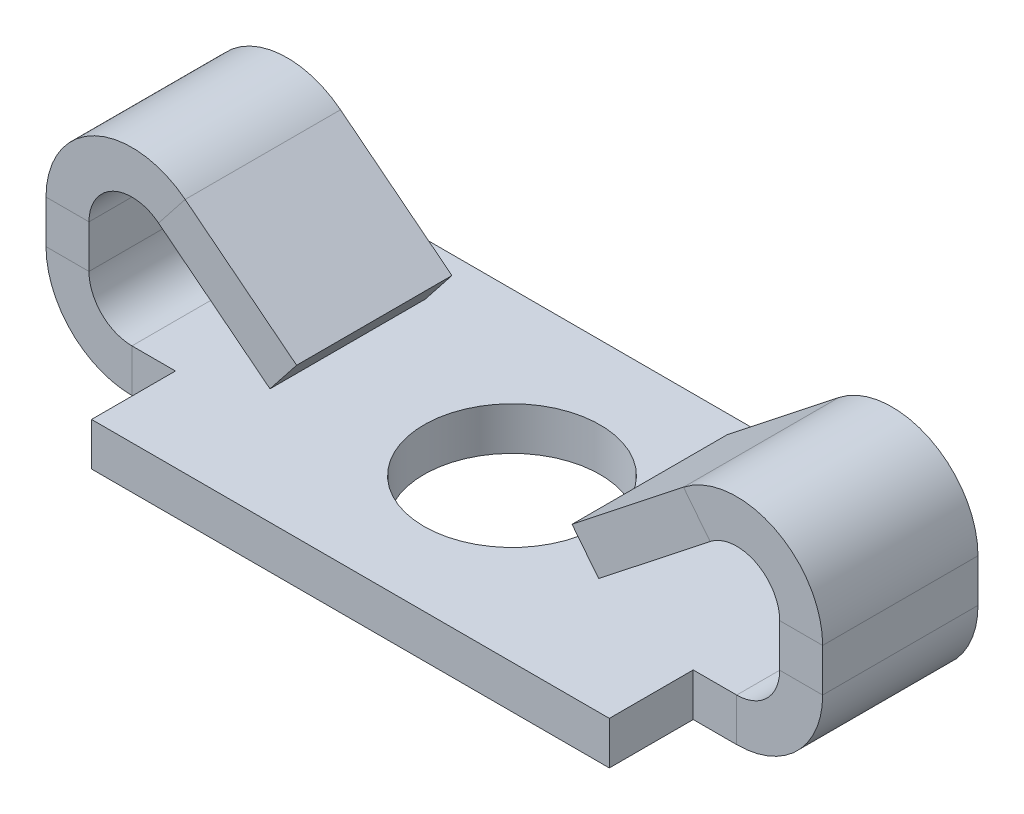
ISO-10303-21;
HEADER;
FILE_DESCRIPTION(('STEP AP214'),'2;1');
FILE_NAME('part.step','',(''),(''),'','','');
FILE_SCHEMA(('AUTOMOTIVE_DESIGN { 1 0 10303 214 1 1 1 1 }'));
ENDSEC;
DATA;
#1=APPLICATION_CONTEXT('core data for automotive mechanical design processes');
#2=APPLICATION_PROTOCOL_DEFINITION('international standard','automotive_design',2000,#1);
#3=PRODUCT_CONTEXT('',#1,'mechanical');
#4=PRODUCT('Part','Part','',(#3));
#5=PRODUCT_RELATED_PRODUCT_CATEGORY('part','',(#4));
#6=PRODUCT_DEFINITION_FORMATION('','',#4);
#7=PRODUCT_DEFINITION_CONTEXT('part definition',#1,'design');
#8=PRODUCT_DEFINITION('design','',#6,#7);
#9=PRODUCT_DEFINITION_SHAPE('','',#8);
#10=(LENGTH_UNIT() NAMED_UNIT(*) SI_UNIT(.MILLI.,.METRE.));
#11=(NAMED_UNIT(*) PLANE_ANGLE_UNIT() SI_UNIT($,.RADIAN.));
#12=(NAMED_UNIT(*) SI_UNIT($,.STERADIAN.) SOLID_ANGLE_UNIT());
#13=UNCERTAINTY_MEASURE_WITH_UNIT(LENGTH_MEASURE(1.E-05),#10,'distance_accuracy_value','');
#14=(GEOMETRIC_REPRESENTATION_CONTEXT(3) GLOBAL_UNCERTAINTY_ASSIGNED_CONTEXT((#13)) GLOBAL_UNIT_ASSIGNED_CONTEXT((#10,
#11,#12)) REPRESENTATION_CONTEXT('',''));
#15=CARTESIAN_POINT('',(0.,0.,0.));
#16=DIRECTION('',(0.,0.,1.));
#17=DIRECTION('',(1.,0.,0.));
#18=AXIS2_PLACEMENT_3D('',#15,#16,#17);
#19=CARTESIAN_POINT('',(19.05,0.,7.9248));
#20=DIRECTION('',(0.,-1.,0.));
#21=DIRECTION('',(0.,0.,-1.));
#22=AXIS2_PLACEMENT_3D('',#19,#20,#21);
#23=PLANE('',#22);
#24=CARTESIAN_POINT('',(0.,0.,0.));
#25=DIRECTION('',(0.,1.,0.));
#26=DIRECTION('',(0.,0.,1.));
#27=AXIS2_PLACEMENT_3D('',#24,#25,#26);
#28=CIRCLE('',#27,4.318);
#29=CARTESIAN_POINT('',(0.,0.,4.318));
#30=VERTEX_POINT('',#29);
#31=EDGE_CURVE('E624',#30,#30,#28,.T.);
#32=ORIENTED_EDGE('',*,*,#31,.T.);
#33=EDGE_LOOP('',(#32));
#34=FACE_BOUND('',#33,.T.);
#35=DIRECTION('',(-1.,0.,0.));
#36=VECTOR('',#35,1.);
#37=CARTESIAN_POINT('',(19.05,0.,7.9248));
#38=LINE('',#37,#36);
#39=CARTESIAN_POINT('',(12.7,0.,7.9248));
#40=VERTEX_POINT('',#39);
#41=CARTESIAN_POINT('',(-12.7,0.,7.9248));
#42=VERTEX_POINT('',#41);
#43=EDGE_CURVE('E778',#40,#42,#38,.T.);
#44=ORIENTED_EDGE('',*,*,#43,.T.);
#45=DIRECTION('',(0.,0.,-1.));
#46=VECTOR('',#45,1.);
#47=CARTESIAN_POINT('',(-12.7,0.,7.9248));
#48=LINE('',#47,#46);
#49=CARTESIAN_POINT('',(-12.7,0.,3.81));
#50=VERTEX_POINT('',#49);
#51=EDGE_CURVE('E570',#42,#50,#48,.T.);
#52=ORIENTED_EDGE('',*,*,#51,.T.);
#53=DIRECTION('',(1.,0.,0.));
#54=VECTOR('',#53,1.);
#55=CARTESIAN_POINT('',(19.05,0.,3.81));
#56=LINE('',#55,#54);
#57=CARTESIAN_POINT('',(-14.8336,0.,3.81));
#58=VERTEX_POINT('',#57);
#59=EDGE_CURVE('E563',#50,#58,#56,.F.);
#60=ORIENTED_EDGE('',*,*,#59,.T.);
#61=DIRECTION('',(0.,0.,-1.));
#62=VECTOR('',#61,1.);
#63=CARTESIAN_POINT('',(-14.8336,0.,7.9248));
#64=LINE('',#63,#62);
#65=CARTESIAN_POINT('',(-14.8335999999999,0.,-3.81));
#66=VERTEX_POINT('',#65);
#67=EDGE_CURVE('E819',#58,#66,#64,.T.);
#68=ORIENTED_EDGE('',*,*,#67,.T.);
#69=DIRECTION('',(1.,0.,0.));
#70=VECTOR('',#69,1.);
#71=CARTESIAN_POINT('',(-14.8336,0.,-3.81));
#72=LINE('',#71,#70);
#73=CARTESIAN_POINT('',(-12.7,0.,-3.81000000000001));
#74=VERTEX_POINT('',#73);
#75=EDGE_CURVE('E575',#66,#74,#72,.T.);
#76=ORIENTED_EDGE('',*,*,#75,.T.);
#77=DIRECTION('',(0.,0.,-1.));
#78=VECTOR('',#77,1.);
#79=CARTESIAN_POINT('',(-12.7,0.,-7.9248));
#80=LINE('',#79,#78);
#81=CARTESIAN_POINT('',(-12.7,0.,-7.9248));
#82=VERTEX_POINT('',#81);
#83=EDGE_CURVE('E579',#74,#82,#80,.T.);
#84=ORIENTED_EDGE('',*,*,#83,.T.);
#85=DIRECTION('',(-1.,0.,0.));
#86=VECTOR('',#85,1.);
#87=CARTESIAN_POINT('',(19.05,0.,-7.9248));
#88=LINE('',#87,#86);
#89=CARTESIAN_POINT('',(12.7,0.,-7.9248));
#90=VERTEX_POINT('',#89);
#91=EDGE_CURVE('E771',#90,#82,#88,.T.);
#92=ORIENTED_EDGE('',*,*,#91,.F.);
#93=DIRECTION('',(0.,0.,-1.));
#94=VECTOR('',#93,1.);
#95=CARTESIAN_POINT('',(12.7,0.,7.9248));
#96=LINE('',#95,#94);
#97=CARTESIAN_POINT('',(12.7,0.,-3.81));
#98=VERTEX_POINT('',#97);
#99=EDGE_CURVE('E596',#90,#98,#96,.F.);
#100=ORIENTED_EDGE('',*,*,#99,.T.);
#101=DIRECTION('',(1.,0.,0.));
#102=VECTOR('',#101,1.);
#103=CARTESIAN_POINT('',(19.05,0.,-3.81));
#104=LINE('',#103,#102);
#105=CARTESIAN_POINT('',(14.8336,0.,-3.81));
#106=VERTEX_POINT('',#105);
#107=EDGE_CURVE('E599',#98,#106,#104,.T.);
#108=ORIENTED_EDGE('',*,*,#107,.T.);
#109=DIRECTION('',(0.,0.,-1.));
#110=VECTOR('',#109,1.);
#111=CARTESIAN_POINT('',(14.8336,0.,7.9248));
#112=LINE('',#111,#110);
#113=CARTESIAN_POINT('',(14.8336,0.,3.81));
#114=VERTEX_POINT('',#113);
#115=EDGE_CURVE('E816',#114,#106,#112,.T.);
#116=ORIENTED_EDGE('',*,*,#115,.F.);
#117=DIRECTION('',(-1.,0.,0.));
#118=VECTOR('',#117,1.);
#119=CARTESIAN_POINT('',(14.8336,0.,3.81));
#120=LINE('',#119,#118);
#121=CARTESIAN_POINT('',(12.7,0.,3.81));
#122=VERTEX_POINT('',#121);
#123=EDGE_CURVE('E606',#114,#122,#120,.T.);
#124=ORIENTED_EDGE('',*,*,#123,.T.);
#125=DIRECTION('',(0.,0.,1.));
#126=VECTOR('',#125,1.);
#127=CARTESIAN_POINT('',(12.7,0.,7.9248));
#128=LINE('',#127,#126);
#129=EDGE_CURVE('E611',#122,#40,#128,.T.);
#130=ORIENTED_EDGE('',*,*,#129,.T.);
#131=EDGE_LOOP('',(#44,#52,#60,#68,#76,#84,#92,#100,#108,#116,#124,#130));
#132=FACE_BOUND('',#131,.T.);
#133=ADVANCED_FACE('F360',(#34,#132),#23,.T.);
#134=CARTESIAN_POINT('',(19.05,2.10819999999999,7.9248));
#135=DIRECTION('',(0.,-1.,0.));
#136=DIRECTION('',(0.,0.,-1.));
#137=AXIS2_PLACEMENT_3D('',#134,#135,#136);
#138=PLANE('',#137);
#139=CARTESIAN_POINT('',(0.,2.10819999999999,0.));
#140=DIRECTION('',(0.,1.,0.));
#141=DIRECTION('',(0.,0.,1.));
#142=AXIS2_PLACEMENT_3D('',#139,#140,#141);
#143=CIRCLE('',#142,4.318);
#144=CARTESIAN_POINT('',(0.,2.10819999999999,4.318));
#145=VERTEX_POINT('',#144);
#146=EDGE_CURVE('E627',#145,#145,#143,.T.);
#147=ORIENTED_EDGE('',*,*,#146,.F.);
#148=EDGE_LOOP('',(#147));
#149=FACE_BOUND('',#148,.T.);
#150=DIRECTION('',(0.,0.,-1.));
#151=VECTOR('',#150,1.);
#152=CARTESIAN_POINT('',(-12.7,2.10819999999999,7.9248));
#153=LINE('',#152,#151);
#154=CARTESIAN_POINT('',(-12.7,2.10819999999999,7.9248));
#155=VERTEX_POINT('',#154);
#156=CARTESIAN_POINT('',(-12.7,2.10819999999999,3.81));
#157=VERTEX_POINT('',#156);
#158=EDGE_CURVE('E546',#155,#157,#153,.T.);
#159=ORIENTED_EDGE('',*,*,#158,.F.);
#160=DIRECTION('',(1.,0.,0.));
#161=VECTOR('',#160,1.);
#162=CARTESIAN_POINT('',(19.05,2.10819999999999,7.9248));
#163=LINE('',#162,#161);
#164=CARTESIAN_POINT('',(12.7,2.10819999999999,7.9248));
#165=VERTEX_POINT('',#164);
#166=EDGE_CURVE('E781',#165,#155,#163,.F.);
#167=ORIENTED_EDGE('',*,*,#166,.F.);
#168=DIRECTION('',(0.,0.,-1.));
#169=VECTOR('',#168,1.);
#170=CARTESIAN_POINT('',(12.7,2.10819999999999,7.9248));
#171=LINE('',#170,#169);
#172=CARTESIAN_POINT('',(12.7,2.10819999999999,3.81));
#173=VERTEX_POINT('',#172);
#174=EDGE_CURVE('E616',#173,#165,#171,.F.);
#175=ORIENTED_EDGE('',*,*,#174,.F.);
#176=DIRECTION('',(1.,0.,0.));
#177=VECTOR('',#176,1.);
#178=CARTESIAN_POINT('',(19.05,2.10819999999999,3.81));
#179=LINE('',#178,#177);
#180=CARTESIAN_POINT('',(14.8336,2.10819999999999,3.81));
#181=VERTEX_POINT('',#180);
#182=EDGE_CURVE('E614',#181,#173,#179,.F.);
#183=ORIENTED_EDGE('',*,*,#182,.F.);
#184=DIRECTION('',(0.,0.,-1.));
#185=VECTOR('',#184,1.);
#186=CARTESIAN_POINT('',(14.8336,2.10819999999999,7.9248));
#187=LINE('',#186,#185);
#188=CARTESIAN_POINT('',(14.8336,2.10819999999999,-3.81));
#189=VERTEX_POINT('',#188);
#190=EDGE_CURVE('E789',#181,#189,#187,.T.);
#191=ORIENTED_EDGE('',*,*,#190,.T.);
#192=DIRECTION('',(1.,0.,0.));
#193=VECTOR('',#192,1.);
#194=CARTESIAN_POINT('',(14.8336,2.10819999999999,-3.81000000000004));
#195=LINE('',#194,#193);
#196=CARTESIAN_POINT('',(12.7,2.10819999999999,-3.81));
#197=VERTEX_POINT('',#196);
#198=EDGE_CURVE('E594',#197,#189,#195,.T.);
#199=ORIENTED_EDGE('',*,*,#198,.F.);
#200=DIRECTION('',(0.,0.,1.));
#201=VECTOR('',#200,1.);
#202=CARTESIAN_POINT('',(12.7,2.10819999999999,-7.9248));
#203=LINE('',#202,#201);
#204=CARTESIAN_POINT('',(12.7,2.10819999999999,-7.9248));
#205=VERTEX_POINT('',#204);
#206=EDGE_CURVE('E592',#205,#197,#203,.T.);
#207=ORIENTED_EDGE('',*,*,#206,.F.);
#208=DIRECTION('',(1.,0.,0.));
#209=VECTOR('',#208,1.);
#210=CARTESIAN_POINT('',(19.05,2.10819999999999,-7.9248));
#211=LINE('',#210,#209);
#212=CARTESIAN_POINT('',(-12.7,2.10819999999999,-7.9248));
#213=VERTEX_POINT('',#212);
#214=EDGE_CURVE('E775',#205,#213,#211,.F.);
#215=ORIENTED_EDGE('',*,*,#214,.T.);
#216=DIRECTION('',(0.,0.,-1.));
#217=VECTOR('',#216,1.);
#218=CARTESIAN_POINT('',(-12.7,2.10819999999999,7.9248));
#219=LINE('',#218,#217);
#220=CARTESIAN_POINT('',(-12.7,2.10819999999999,-3.81000000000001));
#221=VERTEX_POINT('',#220);
#222=EDGE_CURVE('E584',#221,#213,#219,.T.);
#223=ORIENTED_EDGE('',*,*,#222,.F.);
#224=DIRECTION('',(1.,0.,0.));
#225=VECTOR('',#224,1.);
#226=CARTESIAN_POINT('',(19.05,2.10819999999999,-3.81));
#227=LINE('',#226,#225);
#228=CARTESIAN_POINT('',(-14.8335999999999,2.10819999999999,-3.81));
#229=VERTEX_POINT('',#228);
#230=EDGE_CURVE('E582',#229,#221,#227,.T.);
#231=ORIENTED_EDGE('',*,*,#230,.F.);
#232=DIRECTION('',(0.,0.,-1.));
#233=VECTOR('',#232,1.);
#234=CARTESIAN_POINT('',(-14.8336,2.10819999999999,7.9248));
#235=LINE('',#234,#233);
#236=CARTESIAN_POINT('',(-14.8336,2.10819999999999,3.81));
#237=VERTEX_POINT('',#236);
#238=EDGE_CURVE('E569',#237,#229,#235,.T.);
#239=ORIENTED_EDGE('',*,*,#238,.F.);
#240=DIRECTION('',(-1.,0.,0.));
#241=VECTOR('',#240,1.);
#242=CARTESIAN_POINT('',(-14.8336,2.10819999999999,3.81000000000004));
#243=LINE('',#242,#241);
#244=EDGE_CURVE('E557',#157,#237,#243,.T.);
#245=ORIENTED_EDGE('',*,*,#244,.F.);
#246=EDGE_LOOP('',(#159,#167,#175,#183,#191,#199,#207,#215,#223,#231,#239,#245));
#247=FACE_BOUND('',#246,.T.);
#248=ADVANCED_FACE('F566',(#149,#247),#138,.F.);
#249=CARTESIAN_POINT('',(16.9418,4.21639999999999,7.9248));
#250=DIRECTION('',(0.,0.,1.));
#251=DIRECTION('',(1.,0.,0.));
#252=AXIS2_PLACEMENT_3D('',#249,#250,#251);
#253=PLANE('',#252);
#254=ORIENTED_EDGE('',*,*,#166,.T.);
#255=DIRECTION('',(0.,1.,0.));
#256=VECTOR('',#255,1.);
#257=CARTESIAN_POINT('',(-12.7,2.10819999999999,7.9248));
#258=LINE('',#257,#256);
#259=EDGE_CURVE('E552',#155,#42,#258,.F.);
#260=ORIENTED_EDGE('',*,*,#259,.T.);
#261=ORIENTED_EDGE('',*,*,#43,.F.);
#262=DIRECTION('',(0.,-1.,0.));
#263=VECTOR('',#262,1.);
#264=CARTESIAN_POINT('',(12.7,0.,7.9248));
#265=LINE('',#264,#263);
#266=EDGE_CURVE('E621',#40,#165,#265,.F.);
#267=ORIENTED_EDGE('',*,*,#266,.T.);
#268=EDGE_LOOP('',(#254,#260,#261,#267));
#269=FACE_BOUND('',#268,.T.);
#270=ADVANCED_FACE('F896',(#269),#253,.T.);
#271=CARTESIAN_POINT('',(-16.9418,4.21639999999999,-7.9248));
#272=DIRECTION('',(0.,0.,-1.));
#273=DIRECTION('',(-1.,0.,0.));
#274=AXIS2_PLACEMENT_3D('',#271,#272,#273);
#275=PLANE('',#274);
#276=ORIENTED_EDGE('',*,*,#91,.T.);
#277=DIRECTION('',(0.,-1.,0.));
#278=VECTOR('',#277,1.);
#279=CARTESIAN_POINT('',(-12.7,0.,-7.9248));
#280=LINE('',#279,#278);
#281=EDGE_CURVE('E589',#82,#213,#280,.F.);
#282=ORIENTED_EDGE('',*,*,#281,.T.);
#283=ORIENTED_EDGE('',*,*,#214,.F.);
#284=DIRECTION('',(0.,1.,0.));
#285=VECTOR('',#284,1.);
#286=CARTESIAN_POINT('',(12.7,2.10819999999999,-7.9248));
#287=LINE('',#286,#285);
#288=EDGE_CURVE('E603',#205,#90,#287,.F.);
#289=ORIENTED_EDGE('',*,*,#288,.T.);
#290=EDGE_LOOP('',(#276,#282,#283,#289));
#291=FACE_BOUND('',#290,.T.);
#292=ADVANCED_FACE('F362',(#291),#275,.T.);
#293=CARTESIAN_POINT('',(-20.355268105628,13.3616349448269,7.9248));
#294=DIRECTION('',(0.619138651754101,0.785281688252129,0.));
#295=DIRECTION('',(-0.785281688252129,0.619138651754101,0.));
#296=AXIS2_PLACEMENT_3D('',#293,#294,#295);
#297=PLANE('',#296);
#298=DIRECTION('',(-0.785281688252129,0.619138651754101,0.));
#299=VECTOR('',#298,1.);
#300=CARTESIAN_POINT('',(-20.355268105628,13.3616349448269,3.81));
#301=LINE('',#300,#299);
#302=CARTESIAN_POINT('',(-13.528331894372,7.97908223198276,3.81));
#303=VERTEX_POINT('',#302);
#304=CARTESIAN_POINT('',(-8.06166810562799,3.66900739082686,3.81));
#305=VERTEX_POINT('',#304);
#306=EDGE_CURVE('E645',#303,#305,#301,.F.);
#307=ORIENTED_EDGE('',*,*,#306,.F.);
#308=DIRECTION('',(0.,0.,-1.));
#309=VECTOR('',#308,1.);
#310=CARTESIAN_POINT('',(-13.528331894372,7.97908223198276,7.9248));
#311=LINE('',#310,#309);
#312=CARTESIAN_POINT('',(-13.528331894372,7.97908223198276,-3.81));
#313=VERTEX_POINT('',#312);
#314=EDGE_CURVE('E375',#303,#313,#311,.T.);
#315=ORIENTED_EDGE('',*,*,#314,.T.);
#316=DIRECTION('',(-0.785281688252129,0.619138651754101,0.));
#317=VECTOR('',#316,1.);
#318=CARTESIAN_POINT('',(-20.355268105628,13.3616349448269,-3.81));
#319=LINE('',#318,#317);
#320=CARTESIAN_POINT('',(-8.06166810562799,3.66900739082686,-3.81));
#321=VERTEX_POINT('',#320);
#322=EDGE_CURVE('E679',#321,#313,#319,.T.);
#323=ORIENTED_EDGE('',*,*,#322,.F.);
#324=DIRECTION('',(0.,0.,-1.));
#325=VECTOR('',#324,1.);
#326=CARTESIAN_POINT('',(-8.06166810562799,3.66900739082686,7.9248));
#327=LINE('',#326,#325);
#328=EDGE_CURVE('E11',#305,#321,#327,.T.);
#329=ORIENTED_EDGE('',*,*,#328,.F.);
#330=EDGE_LOOP('',(#307,#315,#323,#329));
#331=FACE_BOUND('',#330,.T.);
#332=ADVANCED_FACE('F839',(#331),#297,.F.);
#333=CARTESIAN_POINT('',(-6.7564,5.324538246,7.9248));
#334=DIRECTION('',(0.78528168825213,-0.6191386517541,0.));
#335=DIRECTION('',(0.6191386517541,0.78528168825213,0.));
#336=AXIS2_PLACEMENT_3D('',#333,#334,#335);
#337=PLANE('',#336);
#338=DIRECTION('',(0.,0.,-1.));
#339=VECTOR('',#338,1.);
#340=CARTESIAN_POINT('',(-6.7564,5.324538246,7.9248));
#341=LINE('',#340,#339);
#342=CARTESIAN_POINT('',(-6.7564,5.324538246,3.81));
#343=VERTEX_POINT('',#342);
#344=CARTESIAN_POINT('',(-6.75639999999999,5.32453824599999,-3.81000000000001));
#345=VERTEX_POINT('',#344);
#346=EDGE_CURVE('E368',#343,#345,#341,.T.);
#347=ORIENTED_EDGE('',*,*,#346,.F.);
#348=DIRECTION('',(0.619138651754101,0.785281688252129,0.));
#349=VECTOR('',#348,1.);
#350=CARTESIAN_POINT('',(-6.7564,5.324538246,3.81));
#351=LINE('',#350,#349);
#352=EDGE_CURVE('E648',#343,#305,#351,.F.);
#353=ORIENTED_EDGE('',*,*,#352,.T.);
#354=ORIENTED_EDGE('',*,*,#328,.T.);
#355=DIRECTION('',(-0.619138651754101,-0.785281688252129,0.));
#356=VECTOR('',#355,1.);
#357=CARTESIAN_POINT('',(-8.06166810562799,3.66900739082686,-3.81));
#358=LINE('',#357,#356);
#359=EDGE_CURVE('E685',#321,#345,#358,.F.);
#360=ORIENTED_EDGE('',*,*,#359,.T.);
#361=EDGE_LOOP('',(#347,#353,#354,#360));
#362=FACE_BOUND('',#361,.T.);
#363=ADVANCED_FACE('F837',(#362),#337,.T.);
#364=CARTESIAN_POINT('',(-19.05,15.0171658,7.9248));
#365=DIRECTION('',(0.619138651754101,0.785281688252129,0.));
#366=DIRECTION('',(-0.785281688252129,0.619138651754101,0.));
#367=AXIS2_PLACEMENT_3D('',#364,#365,#366);
#368=PLANE('',#367);
#369=DIRECTION('',(0.,0.,-1.));
#370=VECTOR('',#369,1.);
#371=CARTESIAN_POINT('',(-12.223063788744,9.6346130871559,7.9248));
#372=LINE('',#371,#370);
#373=CARTESIAN_POINT('',(-12.223063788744,9.6346130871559,3.81));
#374=VERTEX_POINT('',#373);
#375=CARTESIAN_POINT('',(-12.223063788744,9.63461308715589,-3.81));
#376=VERTEX_POINT('',#375);
#377=EDGE_CURVE('E826',#374,#376,#372,.T.);
#378=ORIENTED_EDGE('',*,*,#377,.F.);
#379=DIRECTION('',(0.785281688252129,-0.619138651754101,0.));
#380=VECTOR('',#379,1.);
#381=CARTESIAN_POINT('',(-19.05,15.0171658,3.81));
#382=LINE('',#381,#380);
#383=EDGE_CURVE('E642',#374,#343,#382,.T.);
#384=ORIENTED_EDGE('',*,*,#383,.T.);
#385=ORIENTED_EDGE('',*,*,#346,.T.);
#386=DIRECTION('',(-0.785281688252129,0.619138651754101,0.));
#387=VECTOR('',#386,1.);
#388=CARTESIAN_POINT('',(-19.05,15.0171658,-3.81000000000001));
#389=LINE('',#388,#387);
#390=EDGE_CURVE('E682',#345,#376,#389,.T.);
#391=ORIENTED_EDGE('',*,*,#390,.T.);
#392=EDGE_LOOP('',(#378,#384,#385,#391));
#393=FACE_BOUND('',#392,.T.);
#394=ADVANCED_FACE('F831',(#393),#368,.T.);
#395=CARTESIAN_POINT('',(-14.8336,6.32355137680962,7.9248));
#396=DIRECTION('',(0.,0.,-1.));
#397=DIRECTION('',(-1.,0.,0.));
#398=AXIS2_PLACEMENT_3D('',#395,#396,#397);
#399=CYLINDRICAL_SURFACE('',#398,4.2164);
#400=DIRECTION('',(0.,0.,-1.));
#401=VECTOR('',#400,1.);
#402=CARTESIAN_POINT('',(-19.05,6.32355137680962,7.9248));
#403=LINE('',#402,#401);
#404=CARTESIAN_POINT('',(-19.05,6.32355137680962,3.81));
#405=VERTEX_POINT('',#404);
#406=CARTESIAN_POINT('',(-19.05,6.32355137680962,-3.81));
#407=VERTEX_POINT('',#406);
#408=EDGE_CURVE('E824',#405,#407,#403,.T.);
#409=ORIENTED_EDGE('',*,*,#408,.F.);
#410=CARTESIAN_POINT('',(-14.8336,6.32355137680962,3.81));
#411=DIRECTION('',(0.,0.,1.));
#412=DIRECTION('',(1.,0.,0.));
#413=AXIS2_PLACEMENT_3D('',#410,#411,#412);
#414=CIRCLE('',#413,4.2164);
#415=EDGE_CURVE('E637',#405,#374,#414,.F.);
#416=ORIENTED_EDGE('',*,*,#415,.T.);
#417=ORIENTED_EDGE('',*,*,#377,.T.);
#418=CARTESIAN_POINT('',(-14.8336,6.32355137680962,-3.81));
#419=DIRECTION('',(0.,0.,-1.));
#420=DIRECTION('',(-1.,0.,0.));
#421=AXIS2_PLACEMENT_3D('',#418,#419,#420);
#422=CIRCLE('',#421,4.2164);
#423=EDGE_CURVE('E676',#376,#407,#422,.F.);
#424=ORIENTED_EDGE('',*,*,#423,.T.);
#425=EDGE_LOOP('',(#409,#416,#417,#424));
#426=FACE_BOUND('',#425,.T.);
#427=ADVANCED_FACE('F870',(#426),#399,.T.);
#428=CARTESIAN_POINT('',(-19.05,0.,7.9248));
#429=DIRECTION('',(-1.,0.,0.));
#430=DIRECTION('',(0.,0.,1.));
#431=AXIS2_PLACEMENT_3D('',#428,#429,#430);
#432=PLANE('',#431);
#433=DIRECTION('',(0.,0.,-1.));
#434=VECTOR('',#433,1.);
#435=CARTESIAN_POINT('',(-19.05,4.21639999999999,7.9248));
#436=LINE('',#435,#434);
#437=CARTESIAN_POINT('',(-19.05,4.21639999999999,3.81));
#438=VERTEX_POINT('',#437);
#439=CARTESIAN_POINT('',(-19.05,4.21639999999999,-3.81));
#440=VERTEX_POINT('',#439);
#441=EDGE_CURVE('E822',#438,#440,#436,.T.);
#442=ORIENTED_EDGE('',*,*,#441,.F.);
#443=DIRECTION('',(0.,-1.,0.));
#444=VECTOR('',#443,1.);
#445=CARTESIAN_POINT('',(-19.05,10.5399513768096,3.81));
#446=LINE('',#445,#444);
#447=EDGE_CURVE('E651',#405,#438,#446,.T.);
#448=ORIENTED_EDGE('',*,*,#447,.F.);
#449=ORIENTED_EDGE('',*,*,#408,.T.);
#450=DIRECTION('',(0.,-1.,0.));
#451=VECTOR('',#450,1.);
#452=CARTESIAN_POINT('',(-19.05,10.5399513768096,-3.81));
#453=LINE('',#452,#451);
#454=EDGE_CURVE('E689',#407,#440,#453,.T.);
#455=ORIENTED_EDGE('',*,*,#454,.T.);
#456=EDGE_LOOP('',(#442,#448,#449,#455));
#457=FACE_BOUND('',#456,.T.);
#458=ADVANCED_FACE('F866',(#457),#432,.T.);
#459=CARTESIAN_POINT('',(-14.8336,4.21639999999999,7.9248));
#460=DIRECTION('',(0.,0.,-1.));
#461=DIRECTION('',(-1.,0.,0.));
#462=AXIS2_PLACEMENT_3D('',#459,#460,#461);
#463=CYLINDRICAL_SURFACE('',#462,4.2164);
#464=ORIENTED_EDGE('',*,*,#67,.F.);
#465=CARTESIAN_POINT('',(-14.8336,4.21639999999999,3.81));
#466=DIRECTION('',(0.,0.,1.));
#467=DIRECTION('',(1.,0.,0.));
#468=AXIS2_PLACEMENT_3D('',#465,#466,#467);
#469=CIRCLE('',#468,4.2164);
#470=EDGE_CURVE('E632',#58,#438,#469,.F.);
#471=ORIENTED_EDGE('',*,*,#470,.T.);
#472=ORIENTED_EDGE('',*,*,#441,.T.);
#473=CARTESIAN_POINT('',(-14.8336,4.21639999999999,-3.81));
#474=DIRECTION('',(0.,0.,-1.));
#475=DIRECTION('',(-1.,0.,0.));
#476=AXIS2_PLACEMENT_3D('',#473,#474,#475);
#477=CIRCLE('',#476,4.2164);
#478=EDGE_CURVE('E667',#440,#66,#477,.F.);
#479=ORIENTED_EDGE('',*,*,#478,.T.);
#480=EDGE_LOOP('',(#464,#471,#472,#479));
#481=FACE_BOUND('',#480,.T.);
#482=ADVANCED_FACE('F904',(#481),#463,.T.);
#483=CARTESIAN_POINT('',(-14.8336,4.21639999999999,7.9248));
#484=DIRECTION('',(0.,0.,-1.));
#485=DIRECTION('',(-1.,0.,0.));
#486=AXIS2_PLACEMENT_3D('',#483,#484,#485);
#487=CYLINDRICAL_SURFACE('',#486,2.1082);
#488=CARTESIAN_POINT('',(-14.8336,4.21639999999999,3.81));
#489=DIRECTION('',(0.,0.,-1.));
#490=DIRECTION('',(-1.,0.,0.));
#491=AXIS2_PLACEMENT_3D('',#488,#489,#490);
#492=CIRCLE('',#491,2.1082);
#493=CARTESIAN_POINT('',(-16.9418,4.21639999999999,3.81));
#494=VERTEX_POINT('',#493);
#495=EDGE_CURVE('E635',#237,#494,#492,.T.);
#496=ORIENTED_EDGE('',*,*,#495,.F.);
#497=ORIENTED_EDGE('',*,*,#238,.T.);
#498=CARTESIAN_POINT('',(-14.8336,4.21639999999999,-3.81));
#499=DIRECTION('',(0.,0.,-1.));
#500=DIRECTION('',(-1.,0.,0.));
#501=AXIS2_PLACEMENT_3D('',#498,#499,#500);
#502=CIRCLE('',#501,2.1082);
#503=CARTESIAN_POINT('',(-16.9418,4.21639999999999,-3.81));
#504=VERTEX_POINT('',#503);
#505=EDGE_CURVE('E670',#504,#229,#502,.F.);
#506=ORIENTED_EDGE('',*,*,#505,.F.);
#507=DIRECTION('',(0.,0.,-1.));
#508=VECTOR('',#507,1.);
#509=CARTESIAN_POINT('',(-16.9418,4.21639999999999,7.9248));
#510=LINE('',#509,#508);
#511=EDGE_CURVE('E786',#494,#504,#510,.T.);
#512=ORIENTED_EDGE('',*,*,#511,.F.);
#513=EDGE_LOOP('',(#496,#497,#506,#512));
#514=FACE_BOUND('',#513,.T.);
#515=ADVANCED_FACE('F860',(#514),#487,.F.);
#516=CARTESIAN_POINT('',(-16.9418,0.,7.9248));
#517=DIRECTION('',(-1.,0.,0.));
#518=DIRECTION('',(0.,0.,1.));
#519=AXIS2_PLACEMENT_3D('',#516,#517,#518);
#520=PLANE('',#519);
#521=DIRECTION('',(0.,1.,0.));
#522=VECTOR('',#521,1.);
#523=CARTESIAN_POINT('',(-16.9418,0.,3.81));
#524=LINE('',#523,#522);
#525=CARTESIAN_POINT('',(-16.9418,6.32355137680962,3.81));
#526=VERTEX_POINT('',#525);
#527=EDGE_CURVE('E655',#526,#494,#524,.F.);
#528=ORIENTED_EDGE('',*,*,#527,.T.);
#529=ORIENTED_EDGE('',*,*,#511,.T.);
#530=DIRECTION('',(0.,1.,0.));
#531=VECTOR('',#530,1.);
#532=CARTESIAN_POINT('',(-16.9418,0.,-3.81));
#533=LINE('',#532,#531);
#534=CARTESIAN_POINT('',(-16.9418,6.32355137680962,-3.81));
#535=VERTEX_POINT('',#534);
#536=EDGE_CURVE('E694',#535,#504,#533,.F.);
#537=ORIENTED_EDGE('',*,*,#536,.F.);
#538=DIRECTION('',(0.,0.,-1.));
#539=VECTOR('',#538,1.);
#540=CARTESIAN_POINT('',(-16.9418,6.32355137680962,7.9248));
#541=LINE('',#540,#539);
#542=EDGE_CURVE('E784',#526,#535,#541,.T.);
#543=ORIENTED_EDGE('',*,*,#542,.F.);
#544=EDGE_LOOP('',(#528,#529,#537,#543));
#545=FACE_BOUND('',#544,.T.);
#546=ADVANCED_FACE('F855',(#545),#520,.F.);
#547=CARTESIAN_POINT('',(-14.8336,6.32355137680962,7.9248));
#548=DIRECTION('',(0.,0.,-1.));
#549=DIRECTION('',(-1.,0.,0.));
#550=AXIS2_PLACEMENT_3D('',#547,#548,#549);
#551=CYLINDRICAL_SURFACE('',#550,2.1082);
#552=CARTESIAN_POINT('',(-14.8336,6.32355137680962,3.81));
#553=DIRECTION('',(0.,0.,-1.));
#554=DIRECTION('',(-1.,0.,0.));
#555=AXIS2_PLACEMENT_3D('',#552,#553,#554);
#556=CIRCLE('',#555,2.1082);
#557=EDGE_CURVE('E640',#526,#303,#556,.T.);
#558=ORIENTED_EDGE('',*,*,#557,.F.);
#559=ORIENTED_EDGE('',*,*,#542,.T.);
#560=CARTESIAN_POINT('',(-14.8336,6.32355137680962,-3.81));
#561=DIRECTION('',(0.,0.,-1.));
#562=DIRECTION('',(-1.,0.,0.));
#563=AXIS2_PLACEMENT_3D('',#560,#561,#562);
#564=CIRCLE('',#563,2.1082);
#565=EDGE_CURVE('E673',#313,#535,#564,.F.);
#566=ORIENTED_EDGE('',*,*,#565,.F.);
#567=ORIENTED_EDGE('',*,*,#314,.F.);
#568=EDGE_LOOP('',(#558,#559,#566,#567));
#569=FACE_BOUND('',#568,.T.);
#570=ADVANCED_FACE('F843',(#569),#551,.F.);
#571=CARTESIAN_POINT('',(14.8336,4.21639999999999,7.9248));
#572=DIRECTION('',(0.,0.,-1.));
#573=DIRECTION('',(-1.,0.,0.));
#574=AXIS2_PLACEMENT_3D('',#571,#572,#573);
#575=CYLINDRICAL_SURFACE('',#574,4.2164);
#576=ORIENTED_EDGE('',*,*,#115,.T.);
#577=CARTESIAN_POINT('',(14.8336,4.21639999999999,-3.81));
#578=DIRECTION('',(0.,0.,-1.));
#579=DIRECTION('',(-1.,0.,0.));
#580=AXIS2_PLACEMENT_3D('',#577,#578,#579);
#581=CIRCLE('',#580,4.2164);
#582=CARTESIAN_POINT('',(19.05,4.21639999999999,-3.81));
#583=VERTEX_POINT('',#582);
#584=EDGE_CURVE('E705',#106,#583,#581,.F.);
#585=ORIENTED_EDGE('',*,*,#584,.T.);
#586=DIRECTION('',(0.,0.,-1.));
#587=VECTOR('',#586,1.);
#588=CARTESIAN_POINT('',(19.05,4.21639999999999,7.9248));
#589=LINE('',#588,#587);
#590=CARTESIAN_POINT('',(19.05,4.21639999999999,3.81));
#591=VERTEX_POINT('',#590);
#592=EDGE_CURVE('E813',#591,#583,#589,.T.);
#593=ORIENTED_EDGE('',*,*,#592,.F.);
#594=CARTESIAN_POINT('',(14.8336,4.21639999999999,3.81));
#595=DIRECTION('',(0.,0.,1.));
#596=DIRECTION('',(1.,0.,0.));
#597=AXIS2_PLACEMENT_3D('',#594,#595,#596);
#598=CIRCLE('',#597,4.2164);
#599=EDGE_CURVE('E740',#591,#114,#598,.F.);
#600=ORIENTED_EDGE('',*,*,#599,.T.);
#601=EDGE_LOOP('',(#576,#585,#593,#600));
#602=FACE_BOUND('',#601,.T.);
#603=ADVANCED_FACE('F902',(#602),#575,.T.);
#604=CARTESIAN_POINT('',(19.05,15.0171658,7.9248));
#605=DIRECTION('',(1.,0.,0.));
#606=DIRECTION('',(0.,0.,-1.));
#607=AXIS2_PLACEMENT_3D('',#604,#605,#606);
#608=PLANE('',#607);
#609=ORIENTED_EDGE('',*,*,#592,.T.);
#610=DIRECTION('',(0.,-1.,0.));
#611=VECTOR('',#610,1.);
#612=CARTESIAN_POINT('',(19.05,10.5399513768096,-3.81));
#613=LINE('',#612,#611);
#614=CARTESIAN_POINT('',(19.05,6.32355137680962,-3.81));
#615=VERTEX_POINT('',#614);
#616=EDGE_CURVE('E724',#615,#583,#613,.T.);
#617=ORIENTED_EDGE('',*,*,#616,.F.);
#618=DIRECTION('',(0.,0.,-1.));
#619=VECTOR('',#618,1.);
#620=CARTESIAN_POINT('',(19.05,6.32355137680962,7.9248));
#621=LINE('',#620,#619);
#622=CARTESIAN_POINT('',(19.05,6.32355137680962,3.81));
#623=VERTEX_POINT('',#622);
#624=EDGE_CURVE('E810',#623,#615,#621,.T.);
#625=ORIENTED_EDGE('',*,*,#624,.F.);
#626=DIRECTION('',(0.,-1.,0.));
#627=VECTOR('',#626,1.);
#628=CARTESIAN_POINT('',(19.05,10.5399513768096,3.81));
#629=LINE('',#628,#627);
#630=EDGE_CURVE('E760',#623,#591,#629,.T.);
#631=ORIENTED_EDGE('',*,*,#630,.T.);
#632=EDGE_LOOP('',(#609,#617,#625,#631));
#633=FACE_BOUND('',#632,.T.);
#634=ADVANCED_FACE('F942',(#633),#608,.T.);
#635=CARTESIAN_POINT('',(14.8336,6.32355137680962,7.9248));
#636=DIRECTION('',(0.,0.,-1.));
#637=DIRECTION('',(-1.,0.,0.));
#638=AXIS2_PLACEMENT_3D('',#635,#636,#637);
#639=CYLINDRICAL_SURFACE('',#638,4.2164);
#640=ORIENTED_EDGE('',*,*,#624,.T.);
#641=CARTESIAN_POINT('',(14.8336,6.32355137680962,-3.81));
#642=DIRECTION('',(0.,0.,-1.));
#643=DIRECTION('',(-1.,0.,0.));
#644=AXIS2_PLACEMENT_3D('',#641,#642,#643);
#645=CIRCLE('',#644,4.2164);
#646=CARTESIAN_POINT('',(12.223063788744,9.63461308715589,-3.81));
#647=VERTEX_POINT('',#646);
#648=EDGE_CURVE('E710',#615,#647,#645,.F.);
#649=ORIENTED_EDGE('',*,*,#648,.T.);
#650=DIRECTION('',(0.,0.,-1.));
#651=VECTOR('',#650,1.);
#652=CARTESIAN_POINT('',(12.223063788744,9.63461308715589,7.9248));
#653=LINE('',#652,#651);
#654=CARTESIAN_POINT('',(12.223063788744,9.63461308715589,3.81));
#655=VERTEX_POINT('',#654);
#656=EDGE_CURVE('E807',#655,#647,#653,.T.);
#657=ORIENTED_EDGE('',*,*,#656,.F.);
#658=CARTESIAN_POINT('',(14.8336,6.32355137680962,3.81));
#659=DIRECTION('',(0.,0.,-1.));
#660=DIRECTION('',(-1.,0.,0.));
#661=AXIS2_PLACEMENT_3D('',#658,#659,#660);
#662=CIRCLE('',#661,4.2164);
#663=EDGE_CURVE('E747',#655,#623,#662,.T.);
#664=ORIENTED_EDGE('',*,*,#663,.T.);
#665=EDGE_LOOP('',(#640,#649,#657,#664));
#666=FACE_BOUND('',#665,.T.);
#667=ADVANCED_FACE('F949',(#666),#639,.T.);
#668=CARTESIAN_POINT('',(6.7564,5.324538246,7.9248));
#669=DIRECTION('',(-0.619138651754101,0.785281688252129,0.));
#670=DIRECTION('',(-0.785281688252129,-0.619138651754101,0.));
#671=AXIS2_PLACEMENT_3D('',#668,#669,#670);
#672=PLANE('',#671);
#673=ORIENTED_EDGE('',*,*,#656,.T.);
#674=DIRECTION('',(-0.785281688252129,-0.619138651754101,0.));
#675=VECTOR('',#674,1.);
#676=CARTESIAN_POINT('',(6.7564,5.324538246,-3.81));
#677=LINE('',#676,#675);
#678=CARTESIAN_POINT('',(6.7564,5.324538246,-3.81));
#679=VERTEX_POINT('',#678);
#680=EDGE_CURVE('E715',#647,#679,#677,.T.);
#681=ORIENTED_EDGE('',*,*,#680,.T.);
#682=DIRECTION('',(0.,0.,-1.));
#683=VECTOR('',#682,1.);
#684=CARTESIAN_POINT('',(6.7564,5.324538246,7.9248));
#685=LINE('',#684,#683);
#686=CARTESIAN_POINT('',(6.7564,5.324538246,3.81));
#687=VERTEX_POINT('',#686);
#688=EDGE_CURVE('E804',#687,#679,#685,.T.);
#689=ORIENTED_EDGE('',*,*,#688,.F.);
#690=DIRECTION('',(-0.785281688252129,-0.619138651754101,0.));
#691=VECTOR('',#690,1.);
#692=CARTESIAN_POINT('',(6.7564,5.324538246,3.81));
#693=LINE('',#692,#691);
#694=EDGE_CURVE('E753',#687,#655,#693,.F.);
#695=ORIENTED_EDGE('',*,*,#694,.T.);
#696=EDGE_LOOP('',(#673,#681,#689,#695));
#697=FACE_BOUND('',#696,.T.);
#698=ADVANCED_FACE('F956',(#697),#672,.T.);
#699=CARTESIAN_POINT('',(8.061668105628,3.66900739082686,7.9248));
#700=DIRECTION('',(-0.785281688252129,-0.619138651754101,0.));
#701=DIRECTION('',(0.619138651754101,-0.785281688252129,0.));
#702=AXIS2_PLACEMENT_3D('',#699,#700,#701);
#703=PLANE('',#702);
#704=ORIENTED_EDGE('',*,*,#688,.T.);
#705=DIRECTION('',(-0.619138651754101,0.785281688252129,0.));
#706=VECTOR('',#705,1.);
#707=CARTESIAN_POINT('',(6.7564,5.324538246,-3.81));
#708=LINE('',#707,#706);
#709=CARTESIAN_POINT('',(8.061668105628,3.66900739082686,-3.81));
#710=VERTEX_POINT('',#709);
#711=EDGE_CURVE('E721',#679,#710,#708,.F.);
#712=ORIENTED_EDGE('',*,*,#711,.T.);
#713=DIRECTION('',(0.,0.,-1.));
#714=VECTOR('',#713,1.);
#715=CARTESIAN_POINT('',(8.061668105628,3.66900739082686,7.9248));
#716=LINE('',#715,#714);
#717=CARTESIAN_POINT('',(8.061668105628,3.66900739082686,3.81));
#718=VERTEX_POINT('',#717);
#719=EDGE_CURVE('E801',#718,#710,#716,.T.);
#720=ORIENTED_EDGE('',*,*,#719,.F.);
#721=DIRECTION('',(0.619138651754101,-0.785281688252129,0.));
#722=VECTOR('',#721,1.);
#723=CARTESIAN_POINT('',(8.061668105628,3.66900739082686,3.81));
#724=LINE('',#723,#722);
#725=EDGE_CURVE('E756',#718,#687,#724,.F.);
#726=ORIENTED_EDGE('',*,*,#725,.T.);
#727=EDGE_LOOP('',(#704,#712,#720,#726));
#728=FACE_BOUND('',#727,.T.);
#729=ADVANCED_FACE('F958',(#728),#703,.T.);
#730=CARTESIAN_POINT('',(8.061668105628,3.66900739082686,7.9248));
#731=DIRECTION('',(-0.619138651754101,0.785281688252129,0.));
#732=DIRECTION('',(-0.785281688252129,-0.619138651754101,0.));
#733=AXIS2_PLACEMENT_3D('',#730,#731,#732);
#734=PLANE('',#733);
#735=DIRECTION('',(-0.785281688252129,-0.619138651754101,0.));
#736=VECTOR('',#735,1.);
#737=CARTESIAN_POINT('',(8.061668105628,3.66900739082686,-3.81));
#738=LINE('',#737,#736);
#739=CARTESIAN_POINT('',(13.528331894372,7.97908223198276,-3.81));
#740=VERTEX_POINT('',#739);
#741=EDGE_CURVE('E718',#740,#710,#738,.T.);
#742=ORIENTED_EDGE('',*,*,#741,.F.);
#743=DIRECTION('',(0.,0.,-1.));
#744=VECTOR('',#743,1.);
#745=CARTESIAN_POINT('',(13.528331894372,7.97908223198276,7.9248));
#746=LINE('',#745,#744);
#747=CARTESIAN_POINT('',(13.528331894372,7.97908223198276,3.81));
#748=VERTEX_POINT('',#747);
#749=EDGE_CURVE('E798',#748,#740,#746,.T.);
#750=ORIENTED_EDGE('',*,*,#749,.F.);
#751=DIRECTION('',(0.785281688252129,0.619138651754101,0.));
#752=VECTOR('',#751,1.);
#753=CARTESIAN_POINT('',(8.061668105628,3.66900739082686,3.81));
#754=LINE('',#753,#752);
#755=EDGE_CURVE('E750',#718,#748,#754,.T.);
#756=ORIENTED_EDGE('',*,*,#755,.F.);
#757=ORIENTED_EDGE('',*,*,#719,.T.);
#758=EDGE_LOOP('',(#742,#750,#756,#757));
#759=FACE_BOUND('',#758,.T.);
#760=ADVANCED_FACE('F963',(#759),#734,.F.);
#761=CARTESIAN_POINT('',(14.8336,6.32355137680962,7.9248));
#762=DIRECTION('',(0.,0.,-1.));
#763=DIRECTION('',(-1.,0.,0.));
#764=AXIS2_PLACEMENT_3D('',#761,#762,#763);
#765=CYLINDRICAL_SURFACE('',#764,2.1082);
#766=CARTESIAN_POINT('',(14.8336,6.32355137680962,-3.81));
#767=DIRECTION('',(0.,0.,-1.));
#768=DIRECTION('',(-1.,0.,0.));
#769=AXIS2_PLACEMENT_3D('',#766,#767,#768);
#770=CIRCLE('',#769,2.1082);
#771=CARTESIAN_POINT('',(16.9418,6.32355137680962,-3.81));
#772=VERTEX_POINT('',#771);
#773=EDGE_CURVE('E713',#772,#740,#770,.F.);
#774=ORIENTED_EDGE('',*,*,#773,.F.);
#775=DIRECTION('',(0.,0.,-1.));
#776=VECTOR('',#775,1.);
#777=CARTESIAN_POINT('',(16.9418,6.32355137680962,7.9248));
#778=LINE('',#777,#776);
#779=CARTESIAN_POINT('',(16.9418,6.32355137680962,3.81));
#780=VERTEX_POINT('',#779);
#781=EDGE_CURVE('E795',#780,#772,#778,.T.);
#782=ORIENTED_EDGE('',*,*,#781,.F.);
#783=CARTESIAN_POINT('',(14.8336,6.32355137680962,3.81));
#784=DIRECTION('',(0.,0.,1.));
#785=DIRECTION('',(1.,0.,0.));
#786=AXIS2_PLACEMENT_3D('',#783,#784,#785);
#787=CIRCLE('',#786,2.1082);
#788=EDGE_CURVE('E383',#748,#780,#787,.F.);
#789=ORIENTED_EDGE('',*,*,#788,.F.);
#790=ORIENTED_EDGE('',*,*,#749,.T.);
#791=EDGE_LOOP('',(#774,#782,#789,#790));
#792=FACE_BOUND('',#791,.T.);
#793=ADVANCED_FACE('F966',(#792),#765,.F.);
#794=CARTESIAN_POINT('',(16.9418,15.0171658,7.9248));
#795=DIRECTION('',(1.,0.,0.));
#796=DIRECTION('',(0.,0.,-1.));
#797=AXIS2_PLACEMENT_3D('',#794,#795,#796);
#798=PLANE('',#797);
#799=DIRECTION('',(0.,1.,0.));
#800=VECTOR('',#799,1.);
#801=CARTESIAN_POINT('',(16.9418,15.0171658,-3.81));
#802=LINE('',#801,#800);
#803=CARTESIAN_POINT('',(16.9418,4.21639999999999,-3.81));
#804=VERTEX_POINT('',#803);
#805=EDGE_CURVE('E728',#772,#804,#802,.F.);
#806=ORIENTED_EDGE('',*,*,#805,.T.);
#807=DIRECTION('',(0.,0.,-1.));
#808=VECTOR('',#807,1.);
#809=CARTESIAN_POINT('',(16.9418,4.21639999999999,7.9248));
#810=LINE('',#809,#808);
#811=CARTESIAN_POINT('',(16.9418,4.21639999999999,3.81));
#812=VERTEX_POINT('',#811);
#813=EDGE_CURVE('E792',#812,#804,#810,.T.);
#814=ORIENTED_EDGE('',*,*,#813,.F.);
#815=DIRECTION('',(0.,1.,0.));
#816=VECTOR('',#815,1.);
#817=CARTESIAN_POINT('',(16.9418,15.0171658,3.81));
#818=LINE('',#817,#816);
#819=EDGE_CURVE('E765',#780,#812,#818,.F.);
#820=ORIENTED_EDGE('',*,*,#819,.F.);
#821=ORIENTED_EDGE('',*,*,#781,.T.);
#822=EDGE_LOOP('',(#806,#814,#820,#821));
#823=FACE_BOUND('',#822,.T.);
#824=ADVANCED_FACE('F969',(#823),#798,.F.);
#825=CARTESIAN_POINT('',(14.8336,4.21639999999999,7.9248));
#826=DIRECTION('',(0.,0.,-1.));
#827=DIRECTION('',(-1.,0.,0.));
#828=AXIS2_PLACEMENT_3D('',#825,#826,#827);
#829=CYLINDRICAL_SURFACE('',#828,2.1082);
#830=CARTESIAN_POINT('',(14.8336,4.21639999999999,-3.81));
#831=DIRECTION('',(0.,0.,-1.));
#832=DIRECTION('',(-1.,0.,0.));
#833=AXIS2_PLACEMENT_3D('',#830,#831,#832);
#834=CIRCLE('',#833,2.1082);
#835=EDGE_CURVE('E708',#189,#804,#834,.F.);
#836=ORIENTED_EDGE('',*,*,#835,.F.);
#837=ORIENTED_EDGE('',*,*,#190,.F.);
#838=CARTESIAN_POINT('',(14.8336,4.21639999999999,3.81));
#839=DIRECTION('',(0.,0.,-1.));
#840=DIRECTION('',(-1.,0.,0.));
#841=AXIS2_PLACEMENT_3D('',#838,#839,#840);
#842=CIRCLE('',#841,2.1082);
#843=EDGE_CURVE('E743',#812,#181,#842,.T.);
#844=ORIENTED_EDGE('',*,*,#843,.F.);
#845=ORIENTED_EDGE('',*,*,#813,.T.);
#846=EDGE_LOOP('',(#836,#837,#844,#845));
#847=FACE_BOUND('',#846,.T.);
#848=ADVANCED_FACE('F973',(#847),#829,.F.);
#849=CARTESIAN_POINT('',(19.05,10.5399513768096,3.81));
#850=DIRECTION('',(0.,0.,1.));
#851=DIRECTION('',(0.,-1.,0.));
#852=AXIS2_PLACEMENT_3D('',#849,#850,#851);
#853=PLANE('',#852);
#854=DIRECTION('',(1.,0.,0.));
#855=VECTOR('',#854,1.);
#856=CARTESIAN_POINT('',(19.05,4.21639999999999,3.81));
#857=LINE('',#856,#855);
#858=EDGE_CURVE('E768',#591,#812,#857,.F.);
#859=ORIENTED_EDGE('',*,*,#858,.F.);
#860=ORIENTED_EDGE('',*,*,#630,.F.);
#861=DIRECTION('',(1.,0.,0.));
#862=VECTOR('',#861,1.);
#863=CARTESIAN_POINT('',(19.05,6.32355137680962,3.81));
#864=LINE('',#863,#862);
#865=EDGE_CURVE('E767',#623,#780,#864,.F.);
#866=ORIENTED_EDGE('',*,*,#865,.T.);
#867=ORIENTED_EDGE('',*,*,#819,.T.);
#868=EDGE_LOOP('',(#859,#860,#866,#867));
#869=FACE_BOUND('',#868,.T.);
#870=ADVANCED_FACE('F945',(#869),#853,.T.);
#871=CARTESIAN_POINT('',(8.061668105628,3.66900739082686,3.81));
#872=DIRECTION('',(0.,0.,1.));
#873=DIRECTION('',(0.785281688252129,0.619138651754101,0.));
#874=AXIS2_PLACEMENT_3D('',#871,#872,#873);
#875=PLANE('',#874);
#876=ORIENTED_EDGE('',*,*,#755,.T.);
#877=DIRECTION('',(0.619138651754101,-0.785281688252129,0.));
#878=VECTOR('',#877,1.);
#879=CARTESIAN_POINT('',(13.528331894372,7.97908223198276,3.81));
#880=LINE('',#879,#878);
#881=EDGE_CURVE('E757',#748,#655,#880,.F.);
#882=ORIENTED_EDGE('',*,*,#881,.T.);
#883=ORIENTED_EDGE('',*,*,#694,.F.);
#884=ORIENTED_EDGE('',*,*,#725,.F.);
#885=EDGE_LOOP('',(#876,#882,#883,#884));
#886=FACE_BOUND('',#885,.T.);
#887=ADVANCED_FACE('F952',(#886),#875,.T.);
#888=CARTESIAN_POINT('',(14.8336,6.32355137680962,3.81));
#889=DIRECTION('',(0.,0.,-1.));
#890=DIRECTION('',(-1.,0.,0.));
#891=AXIS2_PLACEMENT_3D('',#888,#889,#890);
#892=PLANE('',#891);
#893=ORIENTED_EDGE('',*,*,#788,.T.);
#894=ORIENTED_EDGE('',*,*,#865,.F.);
#895=ORIENTED_EDGE('',*,*,#663,.F.);
#896=ORIENTED_EDGE('',*,*,#881,.F.);
#897=EDGE_LOOP('',(#893,#894,#895,#896));
#898=FACE_BOUND('',#897,.T.);
#899=ADVANCED_FACE('F950',(#898),#892,.F.);
#900=CARTESIAN_POINT('',(14.8336,4.21639999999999,3.81));
#901=DIRECTION('',(0.,0.,-1.));
#902=DIRECTION('',(-1.,0.,0.));
#903=AXIS2_PLACEMENT_3D('',#900,#901,#902);
#904=PLANE('',#903);
#905=ORIENTED_EDGE('',*,*,#599,.F.);
#906=ORIENTED_EDGE('',*,*,#858,.T.);
#907=ORIENTED_EDGE('',*,*,#843,.T.);
#908=DIRECTION('',(0.,1.,0.));
#909=VECTOR('',#908,1.);
#910=CARTESIAN_POINT('',(14.8336,2.10819999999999,3.81));
#911=LINE('',#910,#909);
#912=EDGE_CURVE('E735',#181,#114,#911,.F.);
#913=ORIENTED_EDGE('',*,*,#912,.T.);
#914=EDGE_LOOP('',(#905,#906,#907,#913));
#915=FACE_BOUND('',#914,.T.);
#916=ADVANCED_FACE('F937',(#915),#904,.F.);
#917=CARTESIAN_POINT('',(19.05,10.5399513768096,-3.81));
#918=DIRECTION('',(0.,0.,1.));
#919=DIRECTION('',(0.,-1.,0.));
#920=AXIS2_PLACEMENT_3D('',#917,#918,#919);
#921=PLANE('',#920);
#922=DIRECTION('',(1.,0.,0.));
#923=VECTOR('',#922,1.);
#924=CARTESIAN_POINT('',(19.05,6.32355137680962,-3.81));
#925=LINE('',#924,#923);
#926=EDGE_CURVE('E732',#615,#772,#925,.F.);
#927=ORIENTED_EDGE('',*,*,#926,.F.);
#928=ORIENTED_EDGE('',*,*,#616,.T.);
#929=DIRECTION('',(1.,0.,0.));
#930=VECTOR('',#929,1.);
#931=CARTESIAN_POINT('',(19.05,4.21639999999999,-3.81));
#932=LINE('',#931,#930);
#933=EDGE_CURVE('E731',#583,#804,#932,.F.);
#934=ORIENTED_EDGE('',*,*,#933,.T.);
#935=ORIENTED_EDGE('',*,*,#805,.F.);
#936=EDGE_LOOP('',(#927,#928,#934,#935));
#937=FACE_BOUND('',#936,.T.);
#938=ADVANCED_FACE('F987',(#937),#921,.F.);
#939=CARTESIAN_POINT('',(6.7564,5.324538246,-3.81));
#940=DIRECTION('',(0.,0.,-1.));
#941=DIRECTION('',(-0.785281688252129,-0.619138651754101,0.));
#942=AXIS2_PLACEMENT_3D('',#939,#940,#941);
#943=PLANE('',#942);
#944=ORIENTED_EDGE('',*,*,#711,.F.);
#945=ORIENTED_EDGE('',*,*,#680,.F.);
#946=DIRECTION('',(-0.619138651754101,0.785281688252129,0.));
#947=VECTOR('',#946,1.);
#948=CARTESIAN_POINT('',(12.223063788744,9.63461308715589,-3.81));
#949=LINE('',#948,#947);
#950=EDGE_CURVE('E720',#647,#740,#949,.F.);
#951=ORIENTED_EDGE('',*,*,#950,.T.);
#952=ORIENTED_EDGE('',*,*,#741,.T.);
#953=EDGE_LOOP('',(#944,#945,#951,#952));
#954=FACE_BOUND('',#953,.T.);
#955=ADVANCED_FACE('F992',(#954),#943,.T.);
#956=CARTESIAN_POINT('',(14.8336,6.32355137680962,-3.81));
#957=DIRECTION('',(0.,0.,1.));
#958=DIRECTION('',(1.,0.,0.));
#959=AXIS2_PLACEMENT_3D('',#956,#957,#958);
#960=PLANE('',#959);
#961=ORIENTED_EDGE('',*,*,#950,.F.);
#962=ORIENTED_EDGE('',*,*,#648,.F.);
#963=ORIENTED_EDGE('',*,*,#926,.T.);
#964=ORIENTED_EDGE('',*,*,#773,.T.);
#965=EDGE_LOOP('',(#961,#962,#963,#964));
#966=FACE_BOUND('',#965,.T.);
#967=ADVANCED_FACE('F990',(#966),#960,.F.);
#968=CARTESIAN_POINT('',(14.8336,4.21639999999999,-3.81));
#969=DIRECTION('',(0.,0.,1.));
#970=DIRECTION('',(1.,0.,0.));
#971=AXIS2_PLACEMENT_3D('',#968,#969,#970);
#972=PLANE('',#971);
#973=ORIENTED_EDGE('',*,*,#933,.F.);
#974=ORIENTED_EDGE('',*,*,#584,.F.);
#975=DIRECTION('',(0.,1.,0.));
#976=VECTOR('',#975,1.);
#977=CARTESIAN_POINT('',(14.8336,2.10819999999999,-3.81));
#978=LINE('',#977,#976);
#979=EDGE_CURVE('E701',#189,#106,#978,.F.);
#980=ORIENTED_EDGE('',*,*,#979,.F.);
#981=ORIENTED_EDGE('',*,*,#835,.T.);
#982=EDGE_LOOP('',(#973,#974,#980,#981));
#983=FACE_BOUND('',#982,.T.);
#984=ADVANCED_FACE('F984',(#983),#972,.F.);
#985=CARTESIAN_POINT('',(-19.05,10.5399513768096,-3.81));
#986=DIRECTION('',(0.,0.,-1.));
#987=DIRECTION('',(0.,-1.,0.));
#988=AXIS2_PLACEMENT_3D('',#985,#986,#987);
#989=PLANE('',#988);
#990=DIRECTION('',(-1.,0.,0.));
#991=VECTOR('',#990,1.);
#992=CARTESIAN_POINT('',(-19.05,4.21639999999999,-3.81));
#993=LINE('',#992,#991);
#994=EDGE_CURVE('E698',#440,#504,#993,.F.);
#995=ORIENTED_EDGE('',*,*,#994,.F.);
#996=ORIENTED_EDGE('',*,*,#454,.F.);
#997=DIRECTION('',(-1.,0.,0.));
#998=VECTOR('',#997,1.);
#999=CARTESIAN_POINT('',(-19.05,6.32355137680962,-3.81));
#1000=LINE('',#999,#998);
#1001=EDGE_CURVE('E697',#407,#535,#1000,.F.);
#1002=ORIENTED_EDGE('',*,*,#1001,.T.);
#1003=ORIENTED_EDGE('',*,*,#536,.T.);
#1004=EDGE_LOOP('',(#995,#996,#1002,#1003));
#1005=FACE_BOUND('',#1004,.T.);
#1006=ADVANCED_FACE('F853',(#1005),#989,.T.);
#1007=CARTESIAN_POINT('',(-20.355268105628,13.3616349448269,-3.81));
#1008=DIRECTION('',(0.,0.,-1.));
#1009=DIRECTION('',(-0.785281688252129,0.619138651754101,0.));
#1010=AXIS2_PLACEMENT_3D('',#1007,#1008,#1009);
#1011=PLANE('',#1010);
#1012=ORIENTED_EDGE('',*,*,#322,.T.);
#1013=DIRECTION('',(-0.619138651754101,-0.785281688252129,0.));
#1014=VECTOR('',#1013,1.);
#1015=CARTESIAN_POINT('',(-13.528331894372,7.97908223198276,-3.81));
#1016=LINE('',#1015,#1014);
#1017=EDGE_CURVE('E686',#313,#376,#1016,.F.);
#1018=ORIENTED_EDGE('',*,*,#1017,.T.);
#1019=ORIENTED_EDGE('',*,*,#390,.F.);
#1020=ORIENTED_EDGE('',*,*,#359,.F.);
#1021=EDGE_LOOP('',(#1012,#1018,#1019,#1020));
#1022=FACE_BOUND('',#1021,.T.);
#1023=ADVANCED_FACE('F836',(#1022),#1011,.T.);
#1024=CARTESIAN_POINT('',(-14.8336,6.32355137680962,-3.81));
#1025=DIRECTION('',(0.,0.,1.));
#1026=DIRECTION('',(1.,0.,0.));
#1027=AXIS2_PLACEMENT_3D('',#1024,#1025,#1026);
#1028=PLANE('',#1027);
#1029=ORIENTED_EDGE('',*,*,#565,.T.);
#1030=ORIENTED_EDGE('',*,*,#1001,.F.);
#1031=ORIENTED_EDGE('',*,*,#423,.F.);
#1032=ORIENTED_EDGE('',*,*,#1017,.F.);
#1033=EDGE_LOOP('',(#1029,#1030,#1031,#1032));
#1034=FACE_BOUND('',#1033,.T.);
#1035=ADVANCED_FACE('F847',(#1034),#1028,.F.);
#1036=CARTESIAN_POINT('',(-14.8336,4.21639999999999,-3.81));
#1037=DIRECTION('',(0.,0.,1.));
#1038=DIRECTION('',(1.,0.,0.));
#1039=AXIS2_PLACEMENT_3D('',#1036,#1037,#1038);
#1040=PLANE('',#1039);
#1041=ORIENTED_EDGE('',*,*,#478,.F.);
#1042=ORIENTED_EDGE('',*,*,#994,.T.);
#1043=ORIENTED_EDGE('',*,*,#505,.T.);
#1044=DIRECTION('',(0.,1.,0.));
#1045=VECTOR('',#1044,1.);
#1046=CARTESIAN_POINT('',(-14.8336,2.10819999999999,-3.81));
#1047=LINE('',#1046,#1045);
#1048=EDGE_CURVE('E662',#229,#66,#1047,.F.);
#1049=ORIENTED_EDGE('',*,*,#1048,.T.);
#1050=EDGE_LOOP('',(#1041,#1042,#1043,#1049));
#1051=FACE_BOUND('',#1050,.T.);
#1052=ADVANCED_FACE('F863',(#1051),#1040,.F.);
#1053=CARTESIAN_POINT('',(-19.05,10.5399513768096,3.81));
#1054=DIRECTION('',(0.,0.,-1.));
#1055=DIRECTION('',(0.,-1.,0.));
#1056=AXIS2_PLACEMENT_3D('',#1053,#1054,#1055);
#1057=PLANE('',#1056);
#1058=DIRECTION('',(-1.,0.,0.));
#1059=VECTOR('',#1058,1.);
#1060=CARTESIAN_POINT('',(-19.05,6.32355137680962,3.81));
#1061=LINE('',#1060,#1059);
#1062=EDGE_CURVE('E659',#405,#526,#1061,.F.);
#1063=ORIENTED_EDGE('',*,*,#1062,.F.);
#1064=ORIENTED_EDGE('',*,*,#447,.T.);
#1065=DIRECTION('',(-1.,0.,0.));
#1066=VECTOR('',#1065,1.);
#1067=CARTESIAN_POINT('',(-19.05,4.21639999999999,3.81));
#1068=LINE('',#1067,#1066);
#1069=EDGE_CURVE('E658',#438,#494,#1068,.F.);
#1070=ORIENTED_EDGE('',*,*,#1069,.T.);
#1071=ORIENTED_EDGE('',*,*,#527,.F.);
#1072=EDGE_LOOP('',(#1063,#1064,#1070,#1071));
#1073=FACE_BOUND('',#1072,.T.);
#1074=ADVANCED_FACE('F877',(#1073),#1057,.F.);
#1075=CARTESIAN_POINT('',(-19.05,15.0171658,3.81));
#1076=DIRECTION('',(0.,0.,1.));
#1077=DIRECTION('',(0.785281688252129,-0.619138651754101,0.));
#1078=AXIS2_PLACEMENT_3D('',#1075,#1076,#1077);
#1079=PLANE('',#1078);
#1080=ORIENTED_EDGE('',*,*,#352,.F.);
#1081=ORIENTED_EDGE('',*,*,#383,.F.);
#1082=DIRECTION('',(0.619138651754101,0.785281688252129,0.));
#1083=VECTOR('',#1082,1.);
#1084=CARTESIAN_POINT('',(-12.223063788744,9.6346130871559,3.81));
#1085=LINE('',#1084,#1083);
#1086=EDGE_CURVE('E647',#374,#303,#1085,.F.);
#1087=ORIENTED_EDGE('',*,*,#1086,.T.);
#1088=ORIENTED_EDGE('',*,*,#306,.T.);
#1089=EDGE_LOOP('',(#1080,#1081,#1087,#1088));
#1090=FACE_BOUND('',#1089,.T.);
#1091=ADVANCED_FACE('F875',(#1090),#1079,.T.);
#1092=CARTESIAN_POINT('',(-14.8336,6.32355137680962,3.81));
#1093=DIRECTION('',(0.,0.,-1.));
#1094=DIRECTION('',(-1.,0.,0.));
#1095=AXIS2_PLACEMENT_3D('',#1092,#1093,#1094);
#1096=PLANE('',#1095);
#1097=ORIENTED_EDGE('',*,*,#1086,.F.);
#1098=ORIENTED_EDGE('',*,*,#415,.F.);
#1099=ORIENTED_EDGE('',*,*,#1062,.T.);
#1100=ORIENTED_EDGE('',*,*,#557,.T.);
#1101=EDGE_LOOP('',(#1097,#1098,#1099,#1100));
#1102=FACE_BOUND('',#1101,.T.);
#1103=ADVANCED_FACE('F873',(#1102),#1096,.F.);
#1104=CARTESIAN_POINT('',(-14.8336,4.21639999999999,3.81));
#1105=DIRECTION('',(0.,0.,-1.));
#1106=DIRECTION('',(-1.,0.,0.));
#1107=AXIS2_PLACEMENT_3D('',#1104,#1105,#1106);
#1108=PLANE('',#1107);
#1109=ORIENTED_EDGE('',*,*,#1069,.F.);
#1110=ORIENTED_EDGE('',*,*,#470,.F.);
#1111=DIRECTION('',(0.,1.,0.));
#1112=VECTOR('',#1111,1.);
#1113=CARTESIAN_POINT('',(-14.8336,2.10819999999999,3.81));
#1114=LINE('',#1113,#1112);
#1115=EDGE_CURVE('E630',#237,#58,#1114,.F.);
#1116=ORIENTED_EDGE('',*,*,#1115,.F.);
#1117=ORIENTED_EDGE('',*,*,#495,.T.);
#1118=EDGE_LOOP('',(#1109,#1110,#1116,#1117));
#1119=FACE_BOUND('',#1118,.T.);
#1120=ADVANCED_FACE('F884',(#1119),#1108,.F.);
#1121=CARTESIAN_POINT('',(0.,0.,0.));
#1122=DIRECTION('',(0.,1.,0.));
#1123=DIRECTION('',(0.,0.,1.));
#1124=AXIS2_PLACEMENT_3D('',#1121,#1122,#1123);
#1125=CYLINDRICAL_SURFACE('',#1124,4.318);
#1126=ORIENTED_EDGE('',*,*,#146,.T.);
#1127=EDGE_LOOP('',(#1126));
#1128=FACE_BOUND('',#1127,.T.);
#1129=ORIENTED_EDGE('',*,*,#31,.F.);
#1130=EDGE_LOOP('',(#1129));
#1131=FACE_BOUND('',#1130,.T.);
#1132=ADVANCED_FACE('F1068',(#1128,#1131),#1125,.F.);
#1133=CARTESIAN_POINT('',(12.7,0.,7.9248));
#1134=DIRECTION('',(1.,0.,0.));
#1135=DIRECTION('',(0.,0.,1.));
#1136=AXIS2_PLACEMENT_3D('',#1133,#1134,#1135);
#1137=PLANE('',#1136);
#1138=ORIENTED_EDGE('',*,*,#266,.F.);
#1139=ORIENTED_EDGE('',*,*,#129,.F.);
#1140=DIRECTION('',(0.,-1.,0.));
#1141=VECTOR('',#1140,1.);
#1142=CARTESIAN_POINT('',(12.7,0.,3.81));
#1143=LINE('',#1142,#1141);
#1144=EDGE_CURVE('E618',#122,#173,#1143,.F.);
#1145=ORIENTED_EDGE('',*,*,#1144,.T.);
#1146=ORIENTED_EDGE('',*,*,#174,.T.);
#1147=EDGE_LOOP('',(#1138,#1139,#1145,#1146));
#1148=FACE_BOUND('',#1147,.T.);
#1149=ADVANCED_FACE('F927',(#1148),#1137,.T.);
#1150=CARTESIAN_POINT('',(14.8336,0.,3.81));
#1151=DIRECTION('',(0.,0.,1.));
#1152=DIRECTION('',(-1.,0.,0.));
#1153=AXIS2_PLACEMENT_3D('',#1150,#1151,#1152);
#1154=PLANE('',#1153);
#1155=ORIENTED_EDGE('',*,*,#1144,.F.);
#1156=ORIENTED_EDGE('',*,*,#123,.F.);
#1157=ORIENTED_EDGE('',*,*,#912,.F.);
#1158=ORIENTED_EDGE('',*,*,#182,.T.);
#1159=EDGE_LOOP('',(#1155,#1156,#1157,#1158));
#1160=FACE_BOUND('',#1159,.T.);
#1161=ADVANCED_FACE('F930',(#1160),#1154,.T.);
#1162=CARTESIAN_POINT('',(12.7,2.10819999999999,-7.9248));
#1163=DIRECTION('',(1.,0.,0.));
#1164=DIRECTION('',(0.,0.,1.));
#1165=AXIS2_PLACEMENT_3D('',#1162,#1163,#1164);
#1166=PLANE('',#1165);
#1167=ORIENTED_EDGE('',*,*,#288,.F.);
#1168=ORIENTED_EDGE('',*,*,#206,.T.);
#1169=DIRECTION('',(0.,1.,0.));
#1170=VECTOR('',#1169,1.);
#1171=CARTESIAN_POINT('',(12.7,2.10819999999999,-3.81));
#1172=LINE('',#1171,#1170);
#1173=EDGE_CURVE('E602',#197,#98,#1172,.F.);
#1174=ORIENTED_EDGE('',*,*,#1173,.T.);
#1175=ORIENTED_EDGE('',*,*,#99,.F.);
#1176=EDGE_LOOP('',(#1167,#1168,#1174,#1175));
#1177=FACE_BOUND('',#1176,.T.);
#1178=ADVANCED_FACE('F1093',(#1177),#1166,.T.);
#1179=CARTESIAN_POINT('',(14.8336,2.10819999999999,-3.81000000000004));
#1180=DIRECTION('',(0.,0.,-1.));
#1181=DIRECTION('',(1.,0.,0.));
#1182=AXIS2_PLACEMENT_3D('',#1179,#1180,#1181);
#1183=PLANE('',#1182);
#1184=ORIENTED_EDGE('',*,*,#198,.T.);
#1185=ORIENTED_EDGE('',*,*,#979,.T.);
#1186=ORIENTED_EDGE('',*,*,#107,.F.);
#1187=ORIENTED_EDGE('',*,*,#1173,.F.);
#1188=EDGE_LOOP('',(#1184,#1185,#1186,#1187));
#1189=FACE_BOUND('',#1188,.T.);
#1190=ADVANCED_FACE('F981',(#1189),#1183,.T.);
#1191=CARTESIAN_POINT('',(-12.7,0.,-7.9248));
#1192=DIRECTION('',(-1.,0.,0.));
#1193=DIRECTION('',(0.,0.,-1.));
#1194=AXIS2_PLACEMENT_3D('',#1191,#1192,#1193);
#1195=PLANE('',#1194);
#1196=ORIENTED_EDGE('',*,*,#281,.F.);
#1197=ORIENTED_EDGE('',*,*,#83,.F.);
#1198=DIRECTION('',(0.,-1.,0.));
#1199=VECTOR('',#1198,1.);
#1200=CARTESIAN_POINT('',(-12.7,0.,-3.81000000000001));
#1201=LINE('',#1200,#1199);
#1202=EDGE_CURVE('E586',#74,#221,#1201,.F.);
#1203=ORIENTED_EDGE('',*,*,#1202,.T.);
#1204=ORIENTED_EDGE('',*,*,#222,.T.);
#1205=EDGE_LOOP('',(#1196,#1197,#1203,#1204));
#1206=FACE_BOUND('',#1205,.T.);
#1207=ADVANCED_FACE('F1109',(#1206),#1195,.T.);
#1208=CARTESIAN_POINT('',(-14.8336,0.,-3.81));
#1209=DIRECTION('',(0.,0.,-1.));
#1210=DIRECTION('',(1.,0.,0.));
#1211=AXIS2_PLACEMENT_3D('',#1208,#1209,#1210);
#1212=PLANE('',#1211);
#1213=ORIENTED_EDGE('',*,*,#1202,.F.);
#1214=ORIENTED_EDGE('',*,*,#75,.F.);
#1215=ORIENTED_EDGE('',*,*,#1048,.F.);
#1216=ORIENTED_EDGE('',*,*,#230,.T.);
#1217=EDGE_LOOP('',(#1213,#1214,#1215,#1216));
#1218=FACE_BOUND('',#1217,.T.);
#1219=ADVANCED_FACE('F1116',(#1218),#1212,.T.);
#1220=CARTESIAN_POINT('',(-12.7,2.10819999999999,7.9248));
#1221=DIRECTION('',(-1.,0.,0.));
#1222=DIRECTION('',(0.,0.,-1.));
#1223=AXIS2_PLACEMENT_3D('',#1220,#1221,#1222);
#1224=PLANE('',#1223);
#1225=ORIENTED_EDGE('',*,*,#259,.F.);
#1226=ORIENTED_EDGE('',*,*,#158,.T.);
#1227=DIRECTION('',(0.,1.,0.));
#1228=VECTOR('',#1227,1.);
#1229=CARTESIAN_POINT('',(-12.7,2.10819999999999,3.81));
#1230=LINE('',#1229,#1228);
#1231=EDGE_CURVE('E549',#157,#50,#1230,.F.);
#1232=ORIENTED_EDGE('',*,*,#1231,.T.);
#1233=ORIENTED_EDGE('',*,*,#51,.F.);
#1234=EDGE_LOOP('',(#1225,#1226,#1232,#1233));
#1235=FACE_BOUND('',#1234,.T.);
#1236=ADVANCED_FACE('F548',(#1235),#1224,.T.);
#1237=CARTESIAN_POINT('',(-14.8336,2.10819999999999,3.81000000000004));
#1238=DIRECTION('',(0.,0.,1.));
#1239=DIRECTION('',(-1.,0.,0.));
#1240=AXIS2_PLACEMENT_3D('',#1237,#1238,#1239);
#1241=PLANE('',#1240);
#1242=ORIENTED_EDGE('',*,*,#244,.T.);
#1243=ORIENTED_EDGE('',*,*,#1115,.T.);
#1244=ORIENTED_EDGE('',*,*,#59,.F.);
#1245=ORIENTED_EDGE('',*,*,#1231,.F.);
#1246=EDGE_LOOP('',(#1242,#1243,#1244,#1245));
#1247=FACE_BOUND('',#1246,.T.);
#1248=ADVANCED_FACE('F560',(#1247),#1241,.T.);
#1249=CLOSED_SHELL('',(#133,#248,#270,#292,#332,#363,#394,#427,#458,#482,#515,#546,#570,#603,
#634,#667,#698,#729,#760,#793,#824,#848,#870,#887,#899,#916,#938,#955,#967,#984,#1006,#1023,
#1035,#1052,#1074,#1091,#1103,#1120,#1132,#1149,#1161,#1178,#1190,#1207,#1219,#1236,#1248));
#1250=MANIFOLD_SOLID_BREP('B2',#1249);
#1251=ADVANCED_BREP_SHAPE_REPRESENTATION('',(#18,#1250),#14);
#1252=SHAPE_DEFINITION_REPRESENTATION(#9,#1251);
ENDSEC;
END-ISO-10303-21;
